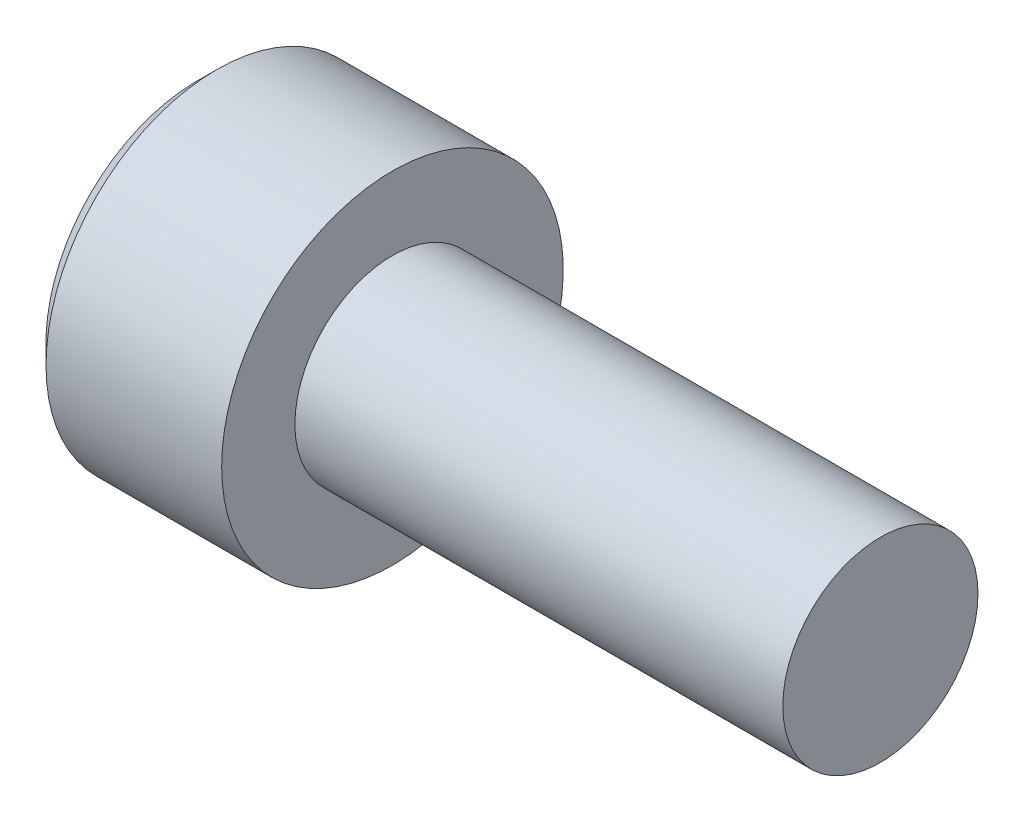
ISO-10303-21;
HEADER;
FILE_DESCRIPTION(('STEP AP214'),'2;1');
FILE_NAME('part.step','',(''),(''),'','','');
FILE_SCHEMA(('AUTOMOTIVE_DESIGN { 1 0 10303 214 1 1 1 1 }'));
ENDSEC;
DATA;
#1=APPLICATION_CONTEXT('core data for automotive mechanical design processes');
#2=APPLICATION_PROTOCOL_DEFINITION('international standard','automotive_design',2000,#1);
#3=PRODUCT_CONTEXT('',#1,'mechanical');
#4=PRODUCT('Part','Part','',(#3));
#5=PRODUCT_RELATED_PRODUCT_CATEGORY('part','',(#4));
#6=PRODUCT_DEFINITION_FORMATION('','',#4);
#7=PRODUCT_DEFINITION_CONTEXT('part definition',#1,'design');
#8=PRODUCT_DEFINITION('design','',#6,#7);
#9=PRODUCT_DEFINITION_SHAPE('','',#8);
#10=(LENGTH_UNIT() NAMED_UNIT(*) SI_UNIT(.MILLI.,.METRE.));
#11=(NAMED_UNIT(*) PLANE_ANGLE_UNIT() SI_UNIT($,.RADIAN.));
#12=(NAMED_UNIT(*) SI_UNIT($,.STERADIAN.) SOLID_ANGLE_UNIT());
#13=UNCERTAINTY_MEASURE_WITH_UNIT(LENGTH_MEASURE(1.E-05),#10,'distance_accuracy_value','');
#14=(GEOMETRIC_REPRESENTATION_CONTEXT(3) GLOBAL_UNCERTAINTY_ASSIGNED_CONTEXT((#13)) GLOBAL_UNIT_ASSIGNED_CONTEXT((#10,
#11,#12)) REPRESENTATION_CONTEXT('',''));
#15=CARTESIAN_POINT('',(0.,0.,0.));
#16=DIRECTION('',(0.,0.,1.));
#17=DIRECTION('',(1.,0.,0.));
#18=AXIS2_PLACEMENT_3D('',#15,#16,#17);
#19=CARTESIAN_POINT('',(-4.,3.5,0.));
#20=DIRECTION('',(1.,0.,0.));
#21=DIRECTION('',(0.,0.,-1.));
#22=AXIS2_PLACEMENT_3D('',#19,#20,#21);
#23=PLANE('',#22);
#24=CARTESIAN_POINT('',(-4.,0.,0.));
#25=DIRECTION('',(1.,0.,0.));
#26=DIRECTION('',(0.,0.,-1.));
#27=AXIS2_PLACEMENT_3D('',#24,#25,#26);
#28=CIRCLE('',#27,3.09999999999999);
#29=CARTESIAN_POINT('',(-4.,0.,-3.09999999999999));
#30=VERTEX_POINT('',#29);
#31=EDGE_CURVE('E45',#30,#30,#28,.F.);
#32=ORIENTED_EDGE('',*,*,#31,.T.);
#33=EDGE_LOOP('',(#32));
#34=FACE_BOUND('',#33,.T.);
#35=DIRECTION('',(0.,0.5,0.866025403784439));
#36=VECTOR('',#35,1.);
#37=CARTESIAN_POINT('',(-4.,-1.73205080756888,0.));
#38=LINE('',#37,#36);
#39=CARTESIAN_POINT('',(-4.,-1.73205080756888,0.));
#40=VERTEX_POINT('',#39);
#41=CARTESIAN_POINT('',(-4.,-0.866025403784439,1.5));
#42=VERTEX_POINT('',#41);
#43=EDGE_CURVE('E152',#40,#42,#38,.T.);
#44=ORIENTED_EDGE('',*,*,#43,.F.);
#45=DIRECTION('',(0.,-0.5,0.866025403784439));
#46=VECTOR('',#45,1.);
#47=CARTESIAN_POINT('',(-4.,-0.866025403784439,-1.5));
#48=LINE('',#47,#46);
#49=CARTESIAN_POINT('',(-4.,-0.866025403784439,-1.5));
#50=VERTEX_POINT('',#49);
#51=EDGE_CURVE('E52',#50,#40,#48,.T.);
#52=ORIENTED_EDGE('',*,*,#51,.F.);
#53=DIRECTION('',(0.,-1.,0.));
#54=VECTOR('',#53,1.);
#55=CARTESIAN_POINT('',(-4.,0.866025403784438,-1.5));
#56=LINE('',#55,#54);
#57=CARTESIAN_POINT('',(-4.,0.866025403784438,-1.5));
#58=VERTEX_POINT('',#57);
#59=EDGE_CURVE('E122',#58,#50,#56,.T.);
#60=ORIENTED_EDGE('',*,*,#59,.F.);
#61=DIRECTION('',(0.,-0.5,-0.866025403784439));
#62=VECTOR('',#61,1.);
#63=CARTESIAN_POINT('',(-4.,1.73205080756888,0.));
#64=LINE('',#63,#62);
#65=CARTESIAN_POINT('',(-4.,1.73205080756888,0.));
#66=VERTEX_POINT('',#65);
#67=EDGE_CURVE('E158',#66,#58,#64,.T.);
#68=ORIENTED_EDGE('',*,*,#67,.F.);
#69=DIRECTION('',(0.,0.499999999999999,-0.866025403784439));
#70=VECTOR('',#69,1.);
#71=CARTESIAN_POINT('',(-4.,0.866025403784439,1.5));
#72=LINE('',#71,#70);
#73=CARTESIAN_POINT('',(-4.,0.866025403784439,1.5));
#74=VERTEX_POINT('',#73);
#75=EDGE_CURVE('E156',#74,#66,#72,.T.);
#76=ORIENTED_EDGE('',*,*,#75,.F.);
#77=DIRECTION('',(0.,1.,0.));
#78=VECTOR('',#77,1.);
#79=CARTESIAN_POINT('',(-4.,-0.866025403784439,1.5));
#80=LINE('',#79,#78);
#81=EDGE_CURVE('E154',#42,#74,#80,.T.);
#82=ORIENTED_EDGE('',*,*,#81,.F.);
#83=EDGE_LOOP('',(#44,#52,#60,#68,#76,#82));
#84=FACE_BOUND('',#83,.T.);
#85=ADVANCED_FACE('F37',(#34,#84),#23,.F.);
#86=CARTESIAN_POINT('',(10.,0.,0.));
#87=DIRECTION('',(-1.,0.,0.));
#88=DIRECTION('',(0.,0.,1.));
#89=AXIS2_PLACEMENT_3D('',#86,#87,#88);
#90=PLANE('',#89);
#91=CARTESIAN_POINT('',(10.,0.,0.));
#92=DIRECTION('',(-1.,0.,0.));
#93=DIRECTION('',(0.,0.,1.));
#94=AXIS2_PLACEMENT_3D('',#91,#92,#93);
#95=CIRCLE('',#94,2.);
#96=CARTESIAN_POINT('',(10.,0.,2.));
#97=VERTEX_POINT('',#96);
#98=EDGE_CURVE('E184',#97,#97,#95,.T.);
#99=ORIENTED_EDGE('',*,*,#98,.F.);
#100=EDGE_LOOP('',(#99));
#101=FACE_BOUND('',#100,.T.);
#102=ADVANCED_FACE('F205',(#101),#90,.F.);
#103=CARTESIAN_POINT('',(-4.,0.,0.));
#104=DIRECTION('',(-1.,0.,0.));
#105=DIRECTION('',(0.,0.,1.));
#106=AXIS2_PLACEMENT_3D('',#103,#104,#105);
#107=CYLINDRICAL_SURFACE('',#106,2.);
#108=CARTESIAN_POINT('',(0.,0.,0.));
#109=DIRECTION('',(-1.,0.,0.));
#110=DIRECTION('',(0.,0.,1.));
#111=AXIS2_PLACEMENT_3D('',#108,#109,#110);
#112=CIRCLE('',#111,2.);
#113=CARTESIAN_POINT('',(0.,0.,2.));
#114=VERTEX_POINT('',#113);
#115=EDGE_CURVE('E181',#114,#114,#112,.T.);
#116=ORIENTED_EDGE('',*,*,#115,.F.);
#117=EDGE_LOOP('',(#116));
#118=FACE_BOUND('',#117,.T.);
#119=ORIENTED_EDGE('',*,*,#98,.T.);
#120=EDGE_LOOP('',(#119));
#121=FACE_BOUND('',#120,.T.);
#122=ADVANCED_FACE('F209',(#118,#121),#107,.T.);
#123=CARTESIAN_POINT('',(0.,2.,0.));
#124=DIRECTION('',(-1.,0.,0.));
#125=DIRECTION('',(0.,0.,1.));
#126=AXIS2_PLACEMENT_3D('',#123,#124,#125);
#127=PLANE('',#126);
#128=CARTESIAN_POINT('',(0.,0.,0.));
#129=DIRECTION('',(-1.,0.,0.));
#130=DIRECTION('',(0.,0.,1.));
#131=AXIS2_PLACEMENT_3D('',#128,#129,#130);
#132=CIRCLE('',#131,3.5);
#133=CARTESIAN_POINT('',(0.,0.,3.5));
#134=VERTEX_POINT('',#133);
#135=EDGE_CURVE('E177',#134,#134,#132,.T.);
#136=ORIENTED_EDGE('',*,*,#135,.F.);
#137=EDGE_LOOP('',(#136));
#138=FACE_BOUND('',#137,.T.);
#139=ORIENTED_EDGE('',*,*,#115,.T.);
#140=EDGE_LOOP('',(#139));
#141=FACE_BOUND('',#140,.T.);
#142=ADVANCED_FACE('F200',(#138,#141),#127,.F.);
#143=CARTESIAN_POINT('',(-4.,0.,0.));
#144=DIRECTION('',(-1.,0.,0.));
#145=DIRECTION('',(0.,0.,1.));
#146=AXIS2_PLACEMENT_3D('',#143,#144,#145);
#147=CYLINDRICAL_SURFACE('',#146,3.5);
#148=CARTESIAN_POINT('',(-3.59999999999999,0.,0.));
#149=DIRECTION('',(1.,0.,0.));
#150=DIRECTION('',(0.,0.,-1.));
#151=AXIS2_PLACEMENT_3D('',#148,#149,#150);
#152=CIRCLE('',#151,3.5);
#153=CARTESIAN_POINT('',(-3.59999999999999,0.,-3.5));
#154=VERTEX_POINT('',#153);
#155=EDGE_CURVE('E11',#154,#154,#152,.T.);
#156=ORIENTED_EDGE('',*,*,#155,.T.);
#157=EDGE_LOOP('',(#156));
#158=FACE_BOUND('',#157,.T.);
#159=ORIENTED_EDGE('',*,*,#135,.T.);
#160=EDGE_LOOP('',(#159));
#161=FACE_BOUND('',#160,.T.);
#162=ADVANCED_FACE('F192',(#158,#161),#147,.T.);
#163=CARTESIAN_POINT('',(-4.,0.,0.));
#164=DIRECTION('',(1.,0.,0.));
#165=DIRECTION('',(0.,0.,-1.));
#166=AXIS2_PLACEMENT_3D('',#163,#164,#165);
#167=CONICAL_SURFACE('',#166,3.09999999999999,0.785398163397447);
#168=ORIENTED_EDGE('',*,*,#155,.F.);
#169=EDGE_LOOP('',(#168));
#170=FACE_BOUND('',#169,.T.);
#171=ORIENTED_EDGE('',*,*,#31,.F.);
#172=EDGE_LOOP('',(#171));
#173=FACE_BOUND('',#172,.T.);
#174=ADVANCED_FACE('F39',(#170,#173),#167,.T.);
#175=CARTESIAN_POINT('',(-2.,-0.866025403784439,-1.5));
#176=DIRECTION('',(0.,-0.866025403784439,-0.5));
#177=DIRECTION('',(0.,0.5,-0.866025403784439));
#178=AXIS2_PLACEMENT_3D('',#175,#176,#177);
#179=PLANE('',#178);
#180=DIRECTION('',(0.,-0.5,0.866025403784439));
#181=VECTOR('',#180,1.);
#182=CARTESIAN_POINT('',(-2.,-0.866025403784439,-1.5));
#183=LINE('',#182,#181);
#184=CARTESIAN_POINT('',(-2.,-0.866025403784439,-1.5));
#185=VERTEX_POINT('',#184);
#186=CARTESIAN_POINT('',(-2.,-1.29903810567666,-0.75));
#187=VERTEX_POINT('',#186);
#188=EDGE_CURVE('E121',#185,#187,#183,.T.);
#189=ORIENTED_EDGE('',*,*,#188,.F.);
#190=DIRECTION('',(-1.,0.,0.));
#191=VECTOR('',#190,1.);
#192=CARTESIAN_POINT('',(-2.,-0.866025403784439,-1.5));
#193=LINE('',#192,#191);
#194=EDGE_CURVE('E161',#185,#50,#193,.T.);
#195=ORIENTED_EDGE('',*,*,#194,.T.);
#196=ORIENTED_EDGE('',*,*,#51,.T.);
#197=DIRECTION('',(-1.,0.,0.));
#198=VECTOR('',#197,1.);
#199=CARTESIAN_POINT('',(-2.,-1.73205080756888,0.));
#200=LINE('',#199,#198);
#201=CARTESIAN_POINT('',(-2.,-1.73205080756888,0.));
#202=VERTEX_POINT('',#201);
#203=EDGE_CURVE('E124',#202,#40,#200,.T.);
#204=ORIENTED_EDGE('',*,*,#203,.F.);
#205=EDGE_CURVE('E113',#187,#202,#183,.T.);
#206=ORIENTED_EDGE('',*,*,#205,.F.);
#207=EDGE_LOOP('',(#189,#195,#196,#204,#206));
#208=FACE_BOUND('',#207,.T.);
#209=ADVANCED_FACE('F125',(#208),#179,.F.);
#210=CARTESIAN_POINT('',(-2.,0.866025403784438,-1.5));
#211=DIRECTION('',(0.,0.,-1.));
#212=DIRECTION('',(-1.,0.,0.));
#213=AXIS2_PLACEMENT_3D('',#210,#211,#212);
#214=PLANE('',#213);
#215=DIRECTION('',(0.,-1.,0.));
#216=VECTOR('',#215,1.);
#217=CARTESIAN_POINT('',(-2.,0.866025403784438,-1.5));
#218=LINE('',#217,#216);
#219=CARTESIAN_POINT('',(-2.,0.866025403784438,-1.5));
#220=VERTEX_POINT('',#219);
#221=CARTESIAN_POINT('',(-2.,0.,-1.5));
#222=VERTEX_POINT('',#221);
#223=EDGE_CURVE('E130',#220,#222,#218,.T.);
#224=ORIENTED_EDGE('',*,*,#223,.F.);
#225=DIRECTION('',(-1.,0.,0.));
#226=VECTOR('',#225,1.);
#227=CARTESIAN_POINT('',(-2.,0.866025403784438,-1.5));
#228=LINE('',#227,#226);
#229=EDGE_CURVE('E163',#220,#58,#228,.T.);
#230=ORIENTED_EDGE('',*,*,#229,.T.);
#231=ORIENTED_EDGE('',*,*,#59,.T.);
#232=ORIENTED_EDGE('',*,*,#194,.F.);
#233=EDGE_CURVE('E148',#222,#185,#218,.T.);
#234=ORIENTED_EDGE('',*,*,#233,.F.);
#235=EDGE_LOOP('',(#224,#230,#231,#232,#234));
#236=FACE_BOUND('',#235,.T.);
#237=ADVANCED_FACE('F198',(#236),#214,.F.);
#238=CARTESIAN_POINT('',(-2.,1.73205080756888,0.));
#239=DIRECTION('',(0.,0.866025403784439,-0.5));
#240=DIRECTION('',(0.,0.5,0.866025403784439));
#241=AXIS2_PLACEMENT_3D('',#238,#239,#240);
#242=PLANE('',#241);
#243=DIRECTION('',(0.,-0.5,-0.866025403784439));
#244=VECTOR('',#243,1.);
#245=CARTESIAN_POINT('',(-2.,1.73205080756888,0.));
#246=LINE('',#245,#244);
#247=CARTESIAN_POINT('',(-2.,1.73205080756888,0.));
#248=VERTEX_POINT('',#247);
#249=CARTESIAN_POINT('',(-2.,1.29903810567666,-0.75));
#250=VERTEX_POINT('',#249);
#251=EDGE_CURVE('E145',#248,#250,#246,.T.);
#252=ORIENTED_EDGE('',*,*,#251,.F.);
#253=DIRECTION('',(-1.,0.,0.));
#254=VECTOR('',#253,1.);
#255=CARTESIAN_POINT('',(-2.,1.73205080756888,0.));
#256=LINE('',#255,#254);
#257=EDGE_CURVE('E166',#248,#66,#256,.T.);
#258=ORIENTED_EDGE('',*,*,#257,.T.);
#259=ORIENTED_EDGE('',*,*,#67,.T.);
#260=ORIENTED_EDGE('',*,*,#229,.F.);
#261=EDGE_CURVE('E144',#250,#220,#246,.T.);
#262=ORIENTED_EDGE('',*,*,#261,.F.);
#263=EDGE_LOOP('',(#252,#258,#259,#260,#262));
#264=FACE_BOUND('',#263,.T.);
#265=ADVANCED_FACE('F234',(#264),#242,.F.);
#266=CARTESIAN_POINT('',(-2.,0.866025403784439,1.5));
#267=DIRECTION('',(0.,0.866025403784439,0.5));
#268=DIRECTION('',(0.,-0.5,0.866025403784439));
#269=AXIS2_PLACEMENT_3D('',#266,#267,#268);
#270=PLANE('',#269);
#271=DIRECTION('',(0.,0.499999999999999,-0.866025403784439));
#272=VECTOR('',#271,1.);
#273=CARTESIAN_POINT('',(-2.,0.866025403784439,1.5));
#274=LINE('',#273,#272);
#275=CARTESIAN_POINT('',(-2.,0.866025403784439,1.5));
#276=VERTEX_POINT('',#275);
#277=CARTESIAN_POINT('',(-2.,1.29903810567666,0.749999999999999));
#278=VERTEX_POINT('',#277);
#279=EDGE_CURVE('E141',#276,#278,#274,.T.);
#280=ORIENTED_EDGE('',*,*,#279,.F.);
#281=DIRECTION('',(-1.,0.,0.));
#282=VECTOR('',#281,1.);
#283=CARTESIAN_POINT('',(-2.,0.866025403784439,1.5));
#284=LINE('',#283,#282);
#285=EDGE_CURVE('E169',#276,#74,#284,.T.);
#286=ORIENTED_EDGE('',*,*,#285,.T.);
#287=ORIENTED_EDGE('',*,*,#75,.T.);
#288=ORIENTED_EDGE('',*,*,#257,.F.);
#289=EDGE_CURVE('E140',#278,#248,#274,.T.);
#290=ORIENTED_EDGE('',*,*,#289,.F.);
#291=EDGE_LOOP('',(#280,#286,#287,#288,#290));
#292=FACE_BOUND('',#291,.T.);
#293=ADVANCED_FACE('F230',(#292),#270,.F.);
#294=CARTESIAN_POINT('',(-2.,-0.866025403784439,1.5));
#295=DIRECTION('',(0.,0.,1.));
#296=DIRECTION('',(1.,0.,0.));
#297=AXIS2_PLACEMENT_3D('',#294,#295,#296);
#298=PLANE('',#297);
#299=DIRECTION('',(0.,1.,0.));
#300=VECTOR('',#299,1.);
#301=CARTESIAN_POINT('',(-2.,-0.866025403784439,1.5));
#302=LINE('',#301,#300);
#303=CARTESIAN_POINT('',(-2.,-0.866025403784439,1.5));
#304=VERTEX_POINT('',#303);
#305=CARTESIAN_POINT('',(-2.,0.,1.5));
#306=VERTEX_POINT('',#305);
#307=EDGE_CURVE('E60',#304,#306,#302,.T.);
#308=ORIENTED_EDGE('',*,*,#307,.F.);
#309=DIRECTION('',(-1.,0.,0.));
#310=VECTOR('',#309,1.);
#311=CARTESIAN_POINT('',(-2.,-0.866025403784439,1.5));
#312=LINE('',#311,#310);
#313=EDGE_CURVE('E129',#304,#42,#312,.T.);
#314=ORIENTED_EDGE('',*,*,#313,.T.);
#315=ORIENTED_EDGE('',*,*,#81,.T.);
#316=ORIENTED_EDGE('',*,*,#285,.F.);
#317=EDGE_CURVE('E136',#306,#276,#302,.T.);
#318=ORIENTED_EDGE('',*,*,#317,.F.);
#319=EDGE_LOOP('',(#308,#314,#315,#316,#318));
#320=FACE_BOUND('',#319,.T.);
#321=ADVANCED_FACE('F227',(#320),#298,.F.);
#322=CARTESIAN_POINT('',(-2.,-1.73205080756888,0.));
#323=DIRECTION('',(0.,-0.866025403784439,0.5));
#324=DIRECTION('',(0.,-0.5,-0.866025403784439));
#325=AXIS2_PLACEMENT_3D('',#322,#323,#324);
#326=PLANE('',#325);
#327=DIRECTION('',(0.,0.5,0.866025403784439));
#328=VECTOR('',#327,1.);
#329=CARTESIAN_POINT('',(-2.,-1.73205080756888,0.));
#330=LINE('',#329,#328);
#331=CARTESIAN_POINT('',(-2.,-1.29903810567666,0.750000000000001));
#332=VERTEX_POINT('',#331);
#333=EDGE_CURVE('E116',#202,#332,#330,.T.);
#334=ORIENTED_EDGE('',*,*,#333,.F.);
#335=ORIENTED_EDGE('',*,*,#203,.T.);
#336=ORIENTED_EDGE('',*,*,#43,.T.);
#337=ORIENTED_EDGE('',*,*,#313,.F.);
#338=EDGE_CURVE('E135',#332,#304,#330,.T.);
#339=ORIENTED_EDGE('',*,*,#338,.F.);
#340=EDGE_LOOP('',(#334,#335,#336,#337,#339));
#341=FACE_BOUND('',#340,.T.);
#342=ADVANCED_FACE('F133',(#341),#326,.F.);
#343=CARTESIAN_POINT('',(-2.,0.,0.));
#344=DIRECTION('',(-1.,0.,0.));
#345=DIRECTION('',(0.,0.,1.));
#346=AXIS2_PLACEMENT_3D('',#343,#344,#345);
#347=PLANE('',#346);
#348=ORIENTED_EDGE('',*,*,#317,.T.);
#349=ORIENTED_EDGE('',*,*,#279,.T.);
#350=CARTESIAN_POINT('',(-2.,0.,0.));
#351=DIRECTION('',(-1.,0.,0.));
#352=DIRECTION('',(0.,-1.,0.));
#353=AXIS2_PLACEMENT_3D('',#350,#351,#352);
#354=CIRCLE('',#353,1.5);
#355=EDGE_CURVE('E178',#306,#278,#354,.T.);
#356=ORIENTED_EDGE('',*,*,#355,.F.);
#357=EDGE_LOOP('',(#348,#349,#356));
#358=FACE_BOUND('',#357,.T.);
#359=ADVANCED_FACE('F226',(#358),#347,.T.);
#360=ORIENTED_EDGE('',*,*,#289,.T.);
#361=ORIENTED_EDGE('',*,*,#251,.T.);
#362=EDGE_CURVE('E264',#278,#250,#354,.T.);
#363=ORIENTED_EDGE('',*,*,#362,.F.);
#364=EDGE_LOOP('',(#360,#361,#363));
#365=FACE_BOUND('',#364,.T.);
#366=ADVANCED_FACE('F248',(#365),#347,.T.);
#367=ORIENTED_EDGE('',*,*,#261,.T.);
#368=ORIENTED_EDGE('',*,*,#223,.T.);
#369=EDGE_CURVE('E266',#250,#222,#354,.T.);
#370=ORIENTED_EDGE('',*,*,#369,.F.);
#371=EDGE_LOOP('',(#367,#368,#370));
#372=FACE_BOUND('',#371,.T.);
#373=ADVANCED_FACE('F253',(#372),#347,.T.);
#374=ORIENTED_EDGE('',*,*,#233,.T.);
#375=ORIENTED_EDGE('',*,*,#188,.T.);
#376=EDGE_CURVE('E267',#222,#187,#354,.T.);
#377=ORIENTED_EDGE('',*,*,#376,.F.);
#378=EDGE_LOOP('',(#374,#375,#377));
#379=FACE_BOUND('',#378,.T.);
#380=ADVANCED_FACE('F246',(#379),#347,.T.);
#381=ORIENTED_EDGE('',*,*,#205,.T.);
#382=ORIENTED_EDGE('',*,*,#333,.T.);
#383=EDGE_CURVE('E118',#187,#332,#354,.T.);
#384=ORIENTED_EDGE('',*,*,#383,.F.);
#385=EDGE_LOOP('',(#381,#382,#384));
#386=FACE_BOUND('',#385,.T.);
#387=ADVANCED_FACE('F114',(#386),#347,.T.);
#388=ORIENTED_EDGE('',*,*,#338,.T.);
#389=ORIENTED_EDGE('',*,*,#307,.T.);
#390=EDGE_CURVE('E174',#332,#306,#354,.T.);
#391=ORIENTED_EDGE('',*,*,#390,.F.);
#392=EDGE_LOOP('',(#388,#389,#391));
#393=FACE_BOUND('',#392,.T.);
#394=ADVANCED_FACE('F221',(#393),#347,.T.);
#395=CARTESIAN_POINT('',(-1.09870907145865,0.,0.));
#396=DIRECTION('',(-1.,0.,0.));
#397=DIRECTION('',(0.,-1.,0.));
#398=AXIS2_PLACEMENT_3D('',#395,#396,#397);
#399=CONICAL_SURFACE('',#398,0.,1.02974425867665);
#400=ORIENTED_EDGE('',*,*,#390,.T.);
#401=ORIENTED_EDGE('',*,*,#355,.T.);
#402=ORIENTED_EDGE('',*,*,#362,.T.);
#403=ORIENTED_EDGE('',*,*,#369,.T.);
#404=ORIENTED_EDGE('',*,*,#376,.T.);
#405=ORIENTED_EDGE('',*,*,#383,.T.);
#406=EDGE_LOOP('',(#400,#401,#402,#403,#404,#405));
#407=FACE_BOUND('',#406,.T.);
#408=CARTESIAN_POINT('',(-1.09870907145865,0.,0.));
#409=VERTEX_POINT('',#408);
#410=VERTEX_LOOP('',#409);
#411=FACE_BOUND('',#410,.T.);
#412=ADVANCED_FACE('F219',(#407,#411),#399,.F.);
#413=CLOSED_SHELL('',(#85,#102,#122,#142,#162,#174,#209,#237,#265,#293,#321,#342,#359,#366,#373,
#380,#387,#394,#412));
#414=MANIFOLD_SOLID_BREP('B2',#413);
#415=ADVANCED_BREP_SHAPE_REPRESENTATION('',(#18,#414),#14);
#416=SHAPE_DEFINITION_REPRESENTATION(#9,#415);
ENDSEC;
END-ISO-10303-21;
